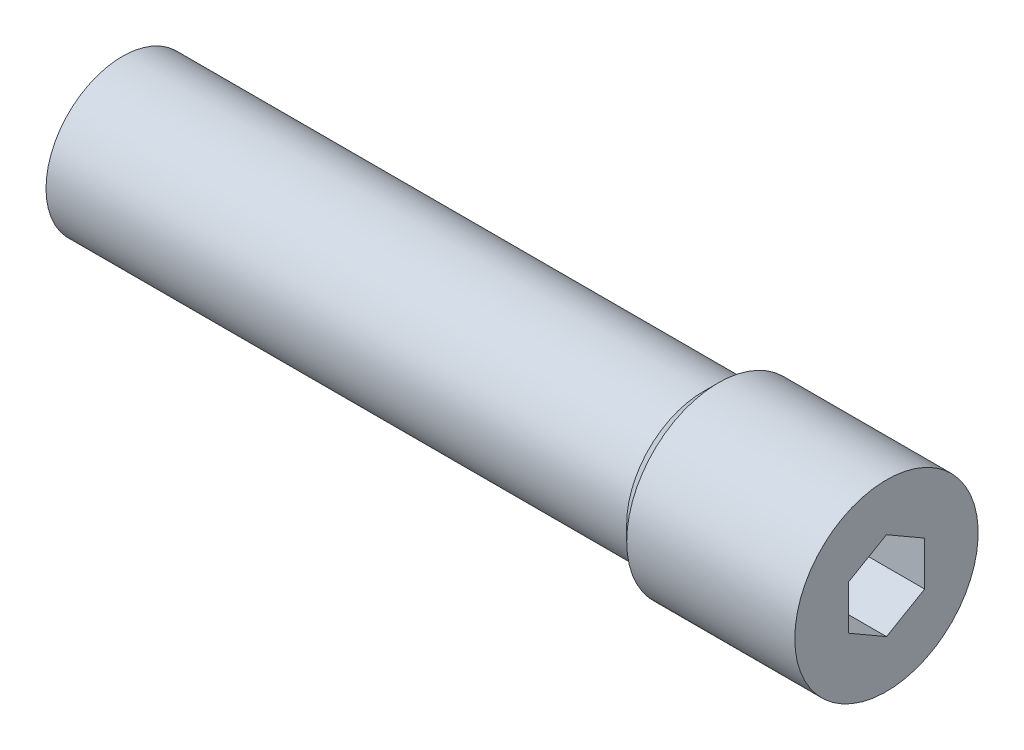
ISO-10303-21;
HEADER;
FILE_DESCRIPTION(('STEP AP214'),'2;1');
FILE_NAME('part.step','',(''),(''),'','','');
FILE_SCHEMA(('AUTOMOTIVE_DESIGN { 1 0 10303 214 1 1 1 1 }'));
ENDSEC;
DATA;
#1=APPLICATION_CONTEXT('core data for automotive mechanical design processes');
#2=APPLICATION_PROTOCOL_DEFINITION('international standard','automotive_design',2000,#1);
#3=PRODUCT_CONTEXT('',#1,'mechanical');
#4=PRODUCT('Part','Part','',(#3));
#5=PRODUCT_RELATED_PRODUCT_CATEGORY('part','',(#4));
#6=PRODUCT_DEFINITION_FORMATION('','',#4);
#7=PRODUCT_DEFINITION_CONTEXT('part definition',#1,'design');
#8=PRODUCT_DEFINITION('design','',#6,#7);
#9=PRODUCT_DEFINITION_SHAPE('','',#8);
#10=(LENGTH_UNIT() NAMED_UNIT(*) SI_UNIT(.MILLI.,.METRE.));
#11=(NAMED_UNIT(*) PLANE_ANGLE_UNIT() SI_UNIT($,.RADIAN.));
#12=(NAMED_UNIT(*) SI_UNIT($,.STERADIAN.) SOLID_ANGLE_UNIT());
#13=UNCERTAINTY_MEASURE_WITH_UNIT(LENGTH_MEASURE(1.E-05),#10,'distance_accuracy_value','');
#14=(GEOMETRIC_REPRESENTATION_CONTEXT(3) GLOBAL_UNCERTAINTY_ASSIGNED_CONTEXT((#13)) GLOBAL_UNIT_ASSIGNED_CONTEXT((#10,
#11,#12)) REPRESENTATION_CONTEXT('',''));
#15=CARTESIAN_POINT('',(0.,0.,0.));
#16=DIRECTION('',(0.,0.,1.));
#17=DIRECTION('',(1.,0.,0.));
#18=AXIS2_PLACEMENT_3D('',#15,#16,#17);
#19=CARTESIAN_POINT('',(0.,0.,0.));
#20=DIRECTION('',(1.,0.,0.));
#21=DIRECTION('',(0.,0.,-1.));
#22=AXIS2_PLACEMENT_3D('',#19,#20,#21);
#23=PLANE('',#22);
#24=CARTESIAN_POINT('',(0.,0.,0.));
#25=DIRECTION('',(-1.,0.,0.));
#26=DIRECTION('',(0.,0.,1.));
#27=AXIS2_PLACEMENT_3D('',#24,#25,#26);
#28=CIRCLE('',#27,5.);
#29=CARTESIAN_POINT('',(0.,0.,5.));
#30=VERTEX_POINT('',#29);
#31=EDGE_CURVE('E10',#30,#30,#28,.T.);
#32=ORIENTED_EDGE('',*,*,#31,.T.);
#33=EDGE_LOOP('',(#32));
#34=FACE_BOUND('',#33,.T.);
#35=ADVANCED_FACE('F16',(#34),#23,.F.);
#36=CARTESIAN_POINT('',(0.,0.,0.));
#37=DIRECTION('',(-1.,0.,0.));
#38=DIRECTION('',(0.,0.,1.));
#39=AXIS2_PLACEMENT_3D('',#36,#37,#38);
#40=CYLINDRICAL_SURFACE('',#39,5.);
#41=ORIENTED_EDGE('',*,*,#31,.F.);
#42=EDGE_LOOP('',(#41));
#43=FACE_BOUND('',#42,.T.);
#44=CARTESIAN_POINT('',(38.,0.,0.));
#45=DIRECTION('',(-1.,0.,0.));
#46=DIRECTION('',(0.,0.,1.));
#47=AXIS2_PLACEMENT_3D('',#44,#45,#46);
#48=CIRCLE('',#47,5.);
#49=CARTESIAN_POINT('',(38.,0.,5.));
#50=VERTEX_POINT('',#49);
#51=EDGE_CURVE('E23',#50,#50,#48,.T.);
#52=ORIENTED_EDGE('',*,*,#51,.T.);
#53=EDGE_LOOP('',(#52));
#54=FACE_BOUND('',#53,.T.);
#55=ADVANCED_FACE('F130',(#43,#54),#40,.T.);
#56=CARTESIAN_POINT('',(39.,0.,0.));
#57=DIRECTION('',(1.,0.,0.));
#58=DIRECTION('',(0.,0.,-1.));
#59=AXIS2_PLACEMENT_3D('',#56,#57,#58);
#60=CONICAL_SURFACE('',#59,6.,0.785398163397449);
#61=ORIENTED_EDGE('',*,*,#51,.F.);
#62=EDGE_LOOP('',(#61));
#63=FACE_BOUND('',#62,.T.);
#64=CARTESIAN_POINT('',(39.,0.,0.));
#65=DIRECTION('',(-1.,0.,0.));
#66=DIRECTION('',(0.,0.,1.));
#67=AXIS2_PLACEMENT_3D('',#64,#65,#66);
#68=CIRCLE('',#67,6.);
#69=CARTESIAN_POINT('',(39.,0.,6.));
#70=VERTEX_POINT('',#69);
#71=EDGE_CURVE('E125',#70,#70,#68,.T.);
#72=ORIENTED_EDGE('',*,*,#71,.T.);
#73=EDGE_LOOP('',(#72));
#74=FACE_BOUND('',#73,.T.);
#75=ADVANCED_FACE('F132',(#63,#74),#60,.T.);
#76=CARTESIAN_POINT('',(0.,0.,0.));
#77=DIRECTION('',(-1.,0.,0.));
#78=DIRECTION('',(0.,0.,1.));
#79=AXIS2_PLACEMENT_3D('',#76,#77,#78);
#80=CYLINDRICAL_SURFACE('',#79,6.);
#81=ORIENTED_EDGE('',*,*,#71,.F.);
#82=EDGE_LOOP('',(#81));
#83=FACE_BOUND('',#82,.T.);
#84=CARTESIAN_POINT('',(50.,0.,0.));
#85=DIRECTION('',(-1.,0.,0.));
#86=DIRECTION('',(0.,0.,1.));
#87=AXIS2_PLACEMENT_3D('',#84,#85,#86);
#88=CIRCLE('',#87,6.);
#89=CARTESIAN_POINT('',(50.,0.,6.));
#90=VERTEX_POINT('',#89);
#91=EDGE_CURVE('E117',#90,#90,#88,.T.);
#92=ORIENTED_EDGE('',*,*,#91,.T.);
#93=EDGE_LOOP('',(#92));
#94=FACE_BOUND('',#93,.T.);
#95=ADVANCED_FACE('F135',(#83,#94),#80,.T.);
#96=CARTESIAN_POINT('',(50.,6.,0.));
#97=DIRECTION('',(-1.,0.,0.));
#98=DIRECTION('',(0.,0.,1.));
#99=AXIS2_PLACEMENT_3D('',#96,#97,#98);
#100=PLANE('',#99);
#101=DIRECTION('',(0.,-0.5,0.866025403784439));
#102=VECTOR('',#101,1.);
#103=CARTESIAN_POINT('',(50.,2.88675134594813,0.));
#104=LINE('',#103,#102);
#105=CARTESIAN_POINT('',(50.,2.88675134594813,0.));
#106=VERTEX_POINT('',#105);
#107=CARTESIAN_POINT('',(50.,1.44337567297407,2.5));
#108=VERTEX_POINT('',#107);
#109=EDGE_CURVE('E104',#106,#108,#104,.T.);
#110=ORIENTED_EDGE('',*,*,#109,.F.);
#111=DIRECTION('',(0.,0.5,0.866025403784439));
#112=VECTOR('',#111,1.);
#113=CARTESIAN_POINT('',(50.,1.44337567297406,-2.5));
#114=LINE('',#113,#112);
#115=CARTESIAN_POINT('',(50.,1.44337567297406,-2.5));
#116=VERTEX_POINT('',#115);
#117=EDGE_CURVE('E30',#116,#106,#114,.T.);
#118=ORIENTED_EDGE('',*,*,#117,.F.);
#119=DIRECTION('',(0.,1.,0.));
#120=VECTOR('',#119,1.);
#121=CARTESIAN_POINT('',(50.,-1.44337567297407,-2.5));
#122=LINE('',#121,#120);
#123=CARTESIAN_POINT('',(50.,-1.44337567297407,-2.5));
#124=VERTEX_POINT('',#123);
#125=EDGE_CURVE('E113',#124,#116,#122,.T.);
#126=ORIENTED_EDGE('',*,*,#125,.F.);
#127=DIRECTION('',(0.,0.5,-0.866025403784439));
#128=VECTOR('',#127,1.);
#129=CARTESIAN_POINT('',(50.,-2.88675134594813,0.));
#130=LINE('',#129,#128);
#131=CARTESIAN_POINT('',(50.,-2.88675134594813,0.));
#132=VERTEX_POINT('',#131);
#133=EDGE_CURVE('E111',#132,#124,#130,.T.);
#134=ORIENTED_EDGE('',*,*,#133,.F.);
#135=DIRECTION('',(0.,-0.5,-0.866025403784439));
#136=VECTOR('',#135,1.);
#137=CARTESIAN_POINT('',(50.,-1.44337567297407,2.5));
#138=LINE('',#137,#136);
#139=CARTESIAN_POINT('',(50.,-1.44337567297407,2.5));
#140=VERTEX_POINT('',#139);
#141=EDGE_CURVE('E78',#140,#132,#138,.T.);
#142=ORIENTED_EDGE('',*,*,#141,.F.);
#143=DIRECTION('',(0.,-1.,0.));
#144=VECTOR('',#143,1.);
#145=CARTESIAN_POINT('',(50.,1.44337567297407,2.5));
#146=LINE('',#145,#144);
#147=EDGE_CURVE('E107',#108,#140,#146,.T.);
#148=ORIENTED_EDGE('',*,*,#147,.F.);
#149=EDGE_LOOP('',(#110,#118,#126,#134,#142,#148));
#150=FACE_BOUND('',#149,.T.);
#151=ORIENTED_EDGE('',*,*,#91,.F.);
#152=EDGE_LOOP('',(#151));
#153=FACE_BOUND('',#152,.T.);
#154=ADVANCED_FACE('F141',(#150,#153),#100,.F.);
#155=CARTESIAN_POINT('',(40.,1.44337567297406,-2.5));
#156=DIRECTION('',(0.,0.866025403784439,-0.5));
#157=DIRECTION('',(0.,0.5,0.866025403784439));
#158=AXIS2_PLACEMENT_3D('',#155,#156,#157);
#159=PLANE('',#158);
#160=ORIENTED_EDGE('',*,*,#117,.T.);
#161=DIRECTION('',(1.,0.,0.));
#162=VECTOR('',#161,1.);
#163=CARTESIAN_POINT('',(40.,2.88675134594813,0.));
#164=LINE('',#163,#162);
#165=CARTESIAN_POINT('',(40.,2.88675134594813,0.));
#166=VERTEX_POINT('',#165);
#167=EDGE_CURVE('E60',#166,#106,#164,.T.);
#168=ORIENTED_EDGE('',*,*,#167,.F.);
#169=DIRECTION('',(0.,0.5,0.866025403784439));
#170=VECTOR('',#169,1.);
#171=CARTESIAN_POINT('',(40.,1.44337567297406,-2.5));
#172=LINE('',#171,#170);
#173=CARTESIAN_POINT('',(40.,1.44337567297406,-2.5));
#174=VERTEX_POINT('',#173);
#175=EDGE_CURVE('E115',#174,#166,#172,.T.);
#176=ORIENTED_EDGE('',*,*,#175,.F.);
#177=DIRECTION('',(1.,0.,0.));
#178=VECTOR('',#177,1.);
#179=CARTESIAN_POINT('',(40.,1.44337567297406,-2.5));
#180=LINE('',#179,#178);
#181=EDGE_CURVE('E38',#174,#116,#180,.T.);
#182=ORIENTED_EDGE('',*,*,#181,.T.);
#183=EDGE_LOOP('',(#160,#168,#176,#182));
#184=FACE_BOUND('',#183,.T.);
#185=ADVANCED_FACE('F146',(#184),#159,.F.);
#186=CARTESIAN_POINT('',(40.,-1.44337567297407,-2.5));
#187=DIRECTION('',(0.,0.,-1.));
#188=DIRECTION('',(0.,1.,0.));
#189=AXIS2_PLACEMENT_3D('',#186,#187,#188);
#190=PLANE('',#189);
#191=ORIENTED_EDGE('',*,*,#125,.T.);
#192=ORIENTED_EDGE('',*,*,#181,.F.);
#193=DIRECTION('',(0.,1.,0.));
#194=VECTOR('',#193,1.);
#195=CARTESIAN_POINT('',(40.,-1.44337567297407,-2.5));
#196=LINE('',#195,#194);
#197=CARTESIAN_POINT('',(40.,-1.44337567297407,-2.5));
#198=VERTEX_POINT('',#197);
#199=EDGE_CURVE('E90',#198,#174,#196,.T.);
#200=ORIENTED_EDGE('',*,*,#199,.F.);
#201=DIRECTION('',(1.,0.,0.));
#202=VECTOR('',#201,1.);
#203=CARTESIAN_POINT('',(40.,-1.44337567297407,-2.5));
#204=LINE('',#203,#202);
#205=EDGE_CURVE('E82',#198,#124,#204,.T.);
#206=ORIENTED_EDGE('',*,*,#205,.T.);
#207=EDGE_LOOP('',(#191,#192,#200,#206));
#208=FACE_BOUND('',#207,.T.);
#209=ADVANCED_FACE('F154',(#208),#190,.F.);
#210=CARTESIAN_POINT('',(40.,-2.88675134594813,0.));
#211=DIRECTION('',(0.,-0.866025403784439,-0.5));
#212=DIRECTION('',(0.,0.5,-0.866025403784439));
#213=AXIS2_PLACEMENT_3D('',#210,#211,#212);
#214=PLANE('',#213);
#215=ORIENTED_EDGE('',*,*,#133,.T.);
#216=ORIENTED_EDGE('',*,*,#205,.F.);
#217=DIRECTION('',(0.,0.5,-0.866025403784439));
#218=VECTOR('',#217,1.);
#219=CARTESIAN_POINT('',(40.,-2.88675134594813,0.));
#220=LINE('',#219,#218);
#221=CARTESIAN_POINT('',(40.,-2.88675134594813,0.));
#222=VERTEX_POINT('',#221);
#223=EDGE_CURVE('E86',#222,#198,#220,.T.);
#224=ORIENTED_EDGE('',*,*,#223,.F.);
#225=DIRECTION('',(1.,0.,0.));
#226=VECTOR('',#225,1.);
#227=CARTESIAN_POINT('',(40.,-2.88675134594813,0.));
#228=LINE('',#227,#226);
#229=EDGE_CURVE('E71',#222,#132,#228,.T.);
#230=ORIENTED_EDGE('',*,*,#229,.T.);
#231=EDGE_LOOP('',(#215,#216,#224,#230));
#232=FACE_BOUND('',#231,.T.);
#233=ADVANCED_FACE('F87',(#232),#214,.F.);
#234=CARTESIAN_POINT('',(40.,-1.44337567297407,2.5));
#235=DIRECTION('',(0.,-0.866025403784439,0.5));
#236=DIRECTION('',(0.,-0.5,-0.866025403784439));
#237=AXIS2_PLACEMENT_3D('',#234,#235,#236);
#238=PLANE('',#237);
#239=ORIENTED_EDGE('',*,*,#141,.T.);
#240=ORIENTED_EDGE('',*,*,#229,.F.);
#241=DIRECTION('',(0.,-0.5,-0.866025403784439));
#242=VECTOR('',#241,1.);
#243=CARTESIAN_POINT('',(40.,-1.44337567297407,2.5));
#244=LINE('',#243,#242);
#245=CARTESIAN_POINT('',(40.,-1.44337567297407,2.5));
#246=VERTEX_POINT('',#245);
#247=EDGE_CURVE('E75',#246,#222,#244,.T.);
#248=ORIENTED_EDGE('',*,*,#247,.F.);
#249=DIRECTION('',(1.,0.,0.));
#250=VECTOR('',#249,1.);
#251=CARTESIAN_POINT('',(40.,-1.44337567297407,2.5));
#252=LINE('',#251,#250);
#253=EDGE_CURVE('E83',#246,#140,#252,.T.);
#254=ORIENTED_EDGE('',*,*,#253,.T.);
#255=EDGE_LOOP('',(#239,#240,#248,#254));
#256=FACE_BOUND('',#255,.T.);
#257=ADVANCED_FACE('F73',(#256),#238,.F.);
#258=CARTESIAN_POINT('',(40.,1.44337567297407,2.5));
#259=DIRECTION('',(0.,0.,1.));
#260=DIRECTION('',(0.,-1.,0.));
#261=AXIS2_PLACEMENT_3D('',#258,#259,#260);
#262=PLANE('',#261);
#263=ORIENTED_EDGE('',*,*,#147,.T.);
#264=ORIENTED_EDGE('',*,*,#253,.F.);
#265=DIRECTION('',(0.,-1.,0.));
#266=VECTOR('',#265,1.);
#267=CARTESIAN_POINT('',(40.,1.44337567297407,2.5));
#268=LINE('',#267,#266);
#269=CARTESIAN_POINT('',(40.,1.44337567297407,2.5));
#270=VERTEX_POINT('',#269);
#271=EDGE_CURVE('E96',#270,#246,#268,.T.);
#272=ORIENTED_EDGE('',*,*,#271,.F.);
#273=DIRECTION('',(1.,0.,0.));
#274=VECTOR('',#273,1.);
#275=CARTESIAN_POINT('',(40.,1.44337567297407,2.5));
#276=LINE('',#275,#274);
#277=EDGE_CURVE('E120',#270,#108,#276,.T.);
#278=ORIENTED_EDGE('',*,*,#277,.T.);
#279=EDGE_LOOP('',(#263,#264,#272,#278));
#280=FACE_BOUND('',#279,.T.);
#281=ADVANCED_FACE('F221',(#280),#262,.F.);
#282=CARTESIAN_POINT('',(40.,2.88675134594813,0.));
#283=DIRECTION('',(0.,0.866025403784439,0.5));
#284=DIRECTION('',(0.,-0.5,0.866025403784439));
#285=AXIS2_PLACEMENT_3D('',#282,#283,#284);
#286=PLANE('',#285);
#287=ORIENTED_EDGE('',*,*,#109,.T.);
#288=ORIENTED_EDGE('',*,*,#277,.F.);
#289=DIRECTION('',(0.,-0.5,0.866025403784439));
#290=VECTOR('',#289,1.);
#291=CARTESIAN_POINT('',(40.,2.88675134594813,0.));
#292=LINE('',#291,#290);
#293=EDGE_CURVE('E98',#166,#270,#292,.T.);
#294=ORIENTED_EDGE('',*,*,#293,.F.);
#295=ORIENTED_EDGE('',*,*,#167,.T.);
#296=EDGE_LOOP('',(#287,#288,#294,#295));
#297=FACE_BOUND('',#296,.T.);
#298=ADVANCED_FACE('F229',(#297),#286,.F.);
#299=CARTESIAN_POINT('',(40.,0.,0.));
#300=DIRECTION('',(1.,0.,0.));
#301=DIRECTION('',(0.,0.,-1.));
#302=AXIS2_PLACEMENT_3D('',#299,#300,#301);
#303=PLANE('',#302);
#304=ORIENTED_EDGE('',*,*,#175,.T.);
#305=ORIENTED_EDGE('',*,*,#293,.T.);
#306=ORIENTED_EDGE('',*,*,#271,.T.);
#307=ORIENTED_EDGE('',*,*,#247,.T.);
#308=ORIENTED_EDGE('',*,*,#223,.T.);
#309=ORIENTED_EDGE('',*,*,#199,.T.);
#310=EDGE_LOOP('',(#304,#305,#306,#307,#308,#309));
#311=FACE_BOUND('',#310,.T.);
#312=ADVANCED_FACE('F93',(#311),#303,.T.);
#313=CLOSED_SHELL('',(#35,#55,#75,#95,#154,#185,#209,#233,#257,#281,#298,#312));
#314=MANIFOLD_SOLID_BREP('B1',#313);
#315=ADVANCED_BREP_SHAPE_REPRESENTATION('',(#18,#314),#14);
#316=SHAPE_DEFINITION_REPRESENTATION(#9,#315);
ENDSEC;
END-ISO-10303-21;
